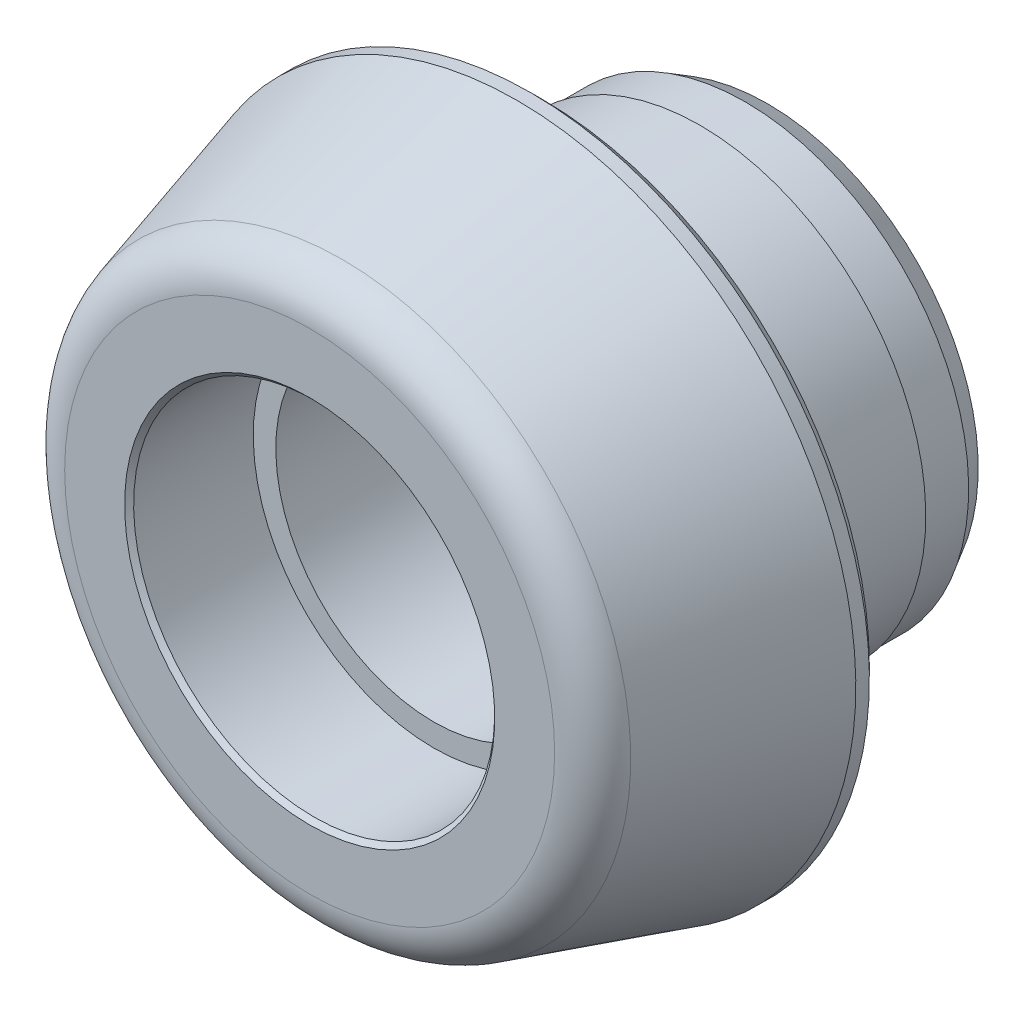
ISO-10303-21;
HEADER;
FILE_DESCRIPTION(('STEP AP214'),'2;1');
FILE_NAME('part.step','',(''),(''),'','','');
FILE_SCHEMA(('AUTOMOTIVE_DESIGN { 1 0 10303 214 1 1 1 1 }'));
ENDSEC;
DATA;
#1=APPLICATION_CONTEXT('core data for automotive mechanical design processes');
#2=APPLICATION_PROTOCOL_DEFINITION('international standard','automotive_design',2000,#1);
#3=PRODUCT_CONTEXT('',#1,'mechanical');
#4=PRODUCT('Part','Part','',(#3));
#5=PRODUCT_RELATED_PRODUCT_CATEGORY('part','',(#4));
#6=PRODUCT_DEFINITION_FORMATION('','',#4);
#7=PRODUCT_DEFINITION_CONTEXT('part definition',#1,'design');
#8=PRODUCT_DEFINITION('design','',#6,#7);
#9=PRODUCT_DEFINITION_SHAPE('','',#8);
#10=(LENGTH_UNIT() NAMED_UNIT(*) SI_UNIT(.MILLI.,.METRE.));
#11=(NAMED_UNIT(*) PLANE_ANGLE_UNIT() SI_UNIT($,.RADIAN.));
#12=(NAMED_UNIT(*) SI_UNIT($,.STERADIAN.) SOLID_ANGLE_UNIT());
#13=UNCERTAINTY_MEASURE_WITH_UNIT(LENGTH_MEASURE(1.E-05),#10,'distance_accuracy_value','');
#14=(GEOMETRIC_REPRESENTATION_CONTEXT(3) GLOBAL_UNCERTAINTY_ASSIGNED_CONTEXT((#13)) GLOBAL_UNIT_ASSIGNED_CONTEXT((#10,
#11,#12)) REPRESENTATION_CONTEXT('',''));
#15=CARTESIAN_POINT('',(0.,0.,0.));
#16=DIRECTION('',(0.,0.,1.));
#17=DIRECTION('',(1.,0.,0.));
#18=AXIS2_PLACEMENT_3D('',#15,#16,#17);
#19=CARTESIAN_POINT('',(0.,0.,10.3));
#20=DIRECTION('',(0.,0.,1.));
#21=DIRECTION('',(0.,-1.,0.));
#22=AXIS2_PLACEMENT_3D('',#19,#20,#21);
#23=CYLINDRICAL_SURFACE('',#22,7.);
#24=CARTESIAN_POINT('',(0.,0.,-9.));
#25=DIRECTION('',(0.,0.,-1.));
#26=DIRECTION('',(0.,1.,0.));
#27=AXIS2_PLACEMENT_3D('',#24,#25,#26);
#28=CIRCLE('',#27,7.);
#29=CARTESIAN_POINT('',(0.,7.,-9.));
#30=VERTEX_POINT('',#29);
#31=EDGE_CURVE('E20',#30,#30,#28,.T.);
#32=ORIENTED_EDGE('',*,*,#31,.T.);
#33=EDGE_LOOP('',(#32));
#34=FACE_BOUND('',#33,.T.);
#35=CARTESIAN_POINT('',(0.,0.,4.8));
#36=DIRECTION('',(0.,0.,1.));
#37=DIRECTION('',(0.,-1.,0.));
#38=AXIS2_PLACEMENT_3D('',#35,#36,#37);
#39=CIRCLE('',#38,7.);
#40=CARTESIAN_POINT('',(0.,-7.,4.8));
#41=VERTEX_POINT('',#40);
#42=EDGE_CURVE('E16',#41,#41,#39,.F.);
#43=ORIENTED_EDGE('',*,*,#42,.F.);
#44=EDGE_LOOP('',(#43));
#45=FACE_BOUND('',#44,.T.);
#46=ADVANCED_FACE('F12',(#34,#45),#23,.F.);
#47=CARTESIAN_POINT('',(0.,0.,-10.));
#48=DIRECTION('',(0.,0.,-1.));
#49=DIRECTION('',(0.,1.,0.));
#50=AXIS2_PLACEMENT_3D('',#47,#48,#49);
#51=CYLINDRICAL_SURFACE('',#50,10.);
#52=CARTESIAN_POINT('',(0.,0.,-7.));
#53=DIRECTION('',(0.,0.,-1.));
#54=DIRECTION('',(0.,1.,0.));
#55=AXIS2_PLACEMENT_3D('',#52,#53,#54);
#56=CIRCLE('',#55,10.);
#57=CARTESIAN_POINT('',(0.,10.,-7.));
#58=VERTEX_POINT('',#57);
#59=EDGE_CURVE('E57',#58,#58,#56,.T.);
#60=ORIENTED_EDGE('',*,*,#59,.F.);
#61=EDGE_LOOP('',(#60));
#62=FACE_BOUND('',#61,.T.);
#63=CARTESIAN_POINT('',(0.,0.,-1.2));
#64=DIRECTION('',(0.,0.,-1.));
#65=DIRECTION('',(0.,1.,0.));
#66=AXIS2_PLACEMENT_3D('',#63,#64,#65);
#67=CIRCLE('',#66,10.);
#68=CARTESIAN_POINT('',(0.,10.,-1.2));
#69=VERTEX_POINT('',#68);
#70=EDGE_CURVE('E51',#69,#69,#67,.T.);
#71=ORIENTED_EDGE('',*,*,#70,.T.);
#72=EDGE_LOOP('',(#71));
#73=FACE_BOUND('',#72,.T.);
#74=ADVANCED_FACE('F102',(#62,#73),#51,.T.);
#75=CARTESIAN_POINT('',(15.,0.,0.));
#76=DIRECTION('',(0.,0.,-1.));
#77=DIRECTION('',(0.,1.,0.));
#78=AXIS2_PLACEMENT_3D('',#75,#76,#77);
#79=PLANE('',#78);
#80=CARTESIAN_POINT('',(0.,0.,0.));
#81=DIRECTION('',(0.,0.,-1.));
#82=DIRECTION('',(0.,1.,0.));
#83=AXIS2_PLACEMENT_3D('',#80,#81,#82);
#84=CIRCLE('',#83,14.5);
#85=CARTESIAN_POINT('',(0.,14.5,0.));
#86=VERTEX_POINT('',#85);
#87=EDGE_CURVE('E69',#86,#86,#84,.T.);
#88=ORIENTED_EDGE('',*,*,#87,.T.);
#89=EDGE_LOOP('',(#88));
#90=FACE_BOUND('',#89,.T.);
#91=CARTESIAN_POINT('',(0.,0.,0.));
#92=DIRECTION('',(0.,0.,-1.));
#93=DIRECTION('',(0.,1.,0.));
#94=AXIS2_PLACEMENT_3D('',#91,#92,#93);
#95=CIRCLE('',#94,10.8);
#96=CARTESIAN_POINT('',(0.,10.8,0.));
#97=VERTEX_POINT('',#96);
#98=EDGE_CURVE('E34',#97,#97,#95,.T.);
#99=ORIENTED_EDGE('',*,*,#98,.F.);
#100=EDGE_LOOP('',(#99));
#101=FACE_BOUND('',#100,.T.);
#102=ADVANCED_FACE('F109',(#90,#101),#79,.T.);
#103=CARTESIAN_POINT('',(10.,0.,-10.));
#104=DIRECTION('',(0.,0.,-1.));
#105=DIRECTION('',(0.,1.,0.));
#106=AXIS2_PLACEMENT_3D('',#103,#104,#105);
#107=PLANE('',#106);
#108=CARTESIAN_POINT('',(0.,0.,-10.));
#109=DIRECTION('',(0.,0.,-1.));
#110=DIRECTION('',(0.,1.,0.));
#111=AXIS2_PLACEMENT_3D('',#108,#109,#110);
#112=CIRCLE('',#111,8.);
#113=CARTESIAN_POINT('',(0.,8.,-10.));
#114=VERTEX_POINT('',#113);
#115=EDGE_CURVE('E8',#114,#114,#112,.F.);
#116=ORIENTED_EDGE('',*,*,#115,.T.);
#117=EDGE_LOOP('',(#116));
#118=FACE_BOUND('',#117,.T.);
#119=CARTESIAN_POINT('',(0.,0.,-10.));
#120=DIRECTION('',(0.,0.,-1.));
#121=DIRECTION('',(0.,1.,0.));
#122=AXIS2_PLACEMENT_3D('',#119,#120,#121);
#123=CIRCLE('',#122,9.32264973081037);
#124=CARTESIAN_POINT('',(0.,9.32264973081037,-10.));
#125=VERTEX_POINT('',#124);
#126=EDGE_CURVE('E75',#125,#125,#123,.T.);
#127=ORIENTED_EDGE('',*,*,#126,.T.);
#128=EDGE_LOOP('',(#127));
#129=FACE_BOUND('',#128,.T.);
#130=ADVANCED_FACE('F119',(#118,#129),#107,.T.);
#131=CARTESIAN_POINT('',(0.,0.,10.3));
#132=DIRECTION('',(0.,0.,1.));
#133=DIRECTION('',(0.,-1.,0.));
#134=AXIS2_PLACEMENT_3D('',#131,#132,#133);
#135=PLANE('',#134);
#136=CARTESIAN_POINT('',(0.,0.,10.3));
#137=DIRECTION('',(0.,0.,1.));
#138=DIRECTION('',(0.,-1.,0.));
#139=AXIS2_PLACEMENT_3D('',#136,#137,#138);
#140=CIRCLE('',#139,8.2);
#141=CARTESIAN_POINT('',(0.,-8.2,10.3));
#142=VERTEX_POINT('',#141);
#143=EDGE_CURVE('E25',#142,#142,#140,.F.);
#144=ORIENTED_EDGE('',*,*,#143,.T.);
#145=EDGE_LOOP('',(#144));
#146=FACE_BOUND('',#145,.T.);
#147=CARTESIAN_POINT('',(0.,0.,10.3));
#148=DIRECTION('',(0.,0.,1.));
#149=DIRECTION('',(0.,-1.,0.));
#150=AXIS2_PLACEMENT_3D('',#147,#148,#149);
#151=CIRCLE('',#150,10.8548343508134);
#152=CARTESIAN_POINT('',(0.,-10.8548343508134,10.3));
#153=VERTEX_POINT('',#152);
#154=EDGE_CURVE('E66',#153,#153,#151,.T.);
#155=ORIENTED_EDGE('',*,*,#154,.T.);
#156=EDGE_LOOP('',(#155));
#157=FACE_BOUND('',#156,.T.);
#158=ADVANCED_FACE('F83',(#146,#157),#135,.T.);
#159=CARTESIAN_POINT('',(0.,0.,1.1));
#160=DIRECTION('',(0.,0.,-1.));
#161=DIRECTION('',(0.,1.,0.));
#162=AXIS2_PLACEMENT_3D('',#159,#160,#161);
#163=CONICAL_SURFACE('',#162,15.,0.279252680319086);
#164=CARTESIAN_POINT('',(0.,0.,8.85127471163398));
#165=DIRECTION('',(0.,0.,1.));
#166=DIRECTION('',(0.,-1.,0.));
#167=AXIS2_PLACEMENT_3D('',#164,#165,#166);
#168=CIRCLE('',#167,12.7773577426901);
#169=CARTESIAN_POINT('',(0.,-12.7773577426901,8.85127471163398));
#170=VERTEX_POINT('',#169);
#171=EDGE_CURVE('E63',#170,#170,#168,.F.);
#172=ORIENTED_EDGE('',*,*,#171,.T.);
#173=EDGE_LOOP('',(#172));
#174=FACE_BOUND('',#173,.T.);
#175=CARTESIAN_POINT('',(0.,0.,1.1));
#176=DIRECTION('',(0.,0.,-1.));
#177=DIRECTION('',(0.,1.,0.));
#178=AXIS2_PLACEMENT_3D('',#175,#176,#177);
#179=CIRCLE('',#178,15.);
#180=CARTESIAN_POINT('',(0.,15.,1.1));
#181=VERTEX_POINT('',#180);
#182=EDGE_CURVE('E60',#181,#181,#179,.T.);
#183=ORIENTED_EDGE('',*,*,#182,.F.);
#184=EDGE_LOOP('',(#183));
#185=FACE_BOUND('',#184,.T.);
#186=ADVANCED_FACE('F124',(#174,#185),#163,.T.);
#187=CARTESIAN_POINT('',(0.,0.,-10.));
#188=DIRECTION('',(0.,0.,-1.));
#189=DIRECTION('',(0.,1.,0.));
#190=AXIS2_PLACEMENT_3D('',#187,#188,#189);
#191=CYLINDRICAL_SURFACE('',#190,15.);
#192=CARTESIAN_POINT('',(0.,0.,0.5));
#193=DIRECTION('',(0.,0.,-1.));
#194=DIRECTION('',(0.,1.,0.));
#195=AXIS2_PLACEMENT_3D('',#192,#193,#194);
#196=CIRCLE('',#195,15.);
#197=CARTESIAN_POINT('',(0.,15.,0.5));
#198=VERTEX_POINT('',#197);
#199=EDGE_CURVE('E72',#198,#198,#196,.F.);
#200=ORIENTED_EDGE('',*,*,#199,.T.);
#201=EDGE_LOOP('',(#200));
#202=FACE_BOUND('',#201,.T.);
#203=ORIENTED_EDGE('',*,*,#182,.T.);
#204=EDGE_LOOP('',(#203));
#205=FACE_BOUND('',#204,.T.);
#206=ADVANCED_FACE('F121',(#202,#205),#191,.T.);
#207=CARTESIAN_POINT('',(-10.,0.,-7.));
#208=DIRECTION('',(0.,0.,-1.));
#209=DIRECTION('',(0.,1.,0.));
#210=AXIS2_PLACEMENT_3D('',#207,#208,#209);
#211=PLANE('',#210);
#212=ORIENTED_EDGE('',*,*,#59,.T.);
#213=EDGE_LOOP('',(#212));
#214=FACE_BOUND('',#213,.T.);
#215=CARTESIAN_POINT('',(0.,0.,-7.));
#216=DIRECTION('',(0.,0.,-1.));
#217=DIRECTION('',(0.,1.,0.));
#218=AXIS2_PLACEMENT_3D('',#215,#216,#217);
#219=CIRCLE('',#218,9.9);
#220=CARTESIAN_POINT('',(0.,9.9,-7.));
#221=VERTEX_POINT('',#220);
#222=EDGE_CURVE('E54',#221,#221,#219,.T.);
#223=ORIENTED_EDGE('',*,*,#222,.F.);
#224=EDGE_LOOP('',(#223));
#225=FACE_BOUND('',#224,.T.);
#226=ADVANCED_FACE('F114',(#214,#225),#211,.T.);
#227=CARTESIAN_POINT('',(0.,0.,-10.));
#228=DIRECTION('',(0.,0.,-1.));
#229=DIRECTION('',(0.,1.,0.));
#230=AXIS2_PLACEMENT_3D('',#227,#228,#229);
#231=CYLINDRICAL_SURFACE('',#230,9.9);
#232=CARTESIAN_POINT('',(0.,0.,-9.));
#233=DIRECTION('',(0.,0.,-1.));
#234=DIRECTION('',(0.,1.,0.));
#235=AXIS2_PLACEMENT_3D('',#232,#233,#234);
#236=CIRCLE('',#235,9.9);
#237=CARTESIAN_POINT('',(0.,9.9,-9.));
#238=VERTEX_POINT('',#237);
#239=EDGE_CURVE('E78',#238,#238,#236,.F.);
#240=ORIENTED_EDGE('',*,*,#239,.T.);
#241=EDGE_LOOP('',(#240));
#242=FACE_BOUND('',#241,.T.);
#243=ORIENTED_EDGE('',*,*,#222,.T.);
#244=EDGE_LOOP('',(#243));
#245=FACE_BOUND('',#244,.T.);
#246=ADVANCED_FACE('F136',(#242,#245),#231,.T.);
#247=CARTESIAN_POINT('',(0.,0.,8.3));
#248=DIRECTION('',(0.,0.,1.));
#249=DIRECTION('',(0.,-1.,0.));
#250=AXIS2_PLACEMENT_3D('',#247,#248,#249);
#251=TOROIDAL_SURFACE('',#250,10.8548343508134,2.);
#252=ORIENTED_EDGE('',*,*,#154,.F.);
#253=EDGE_LOOP('',(#252));
#254=FACE_BOUND('',#253,.T.);
#255=ORIENTED_EDGE('',*,*,#171,.F.);
#256=EDGE_LOOP('',(#255));
#257=FACE_BOUND('',#256,.T.);
#258=ADVANCED_FACE('F133',(#254,#257),#251,.T.);
#259=CARTESIAN_POINT('',(0.,0.,0.));
#260=DIRECTION('',(0.,0.,1.));
#261=DIRECTION('',(0.,-1.,0.));
#262=AXIS2_PLACEMENT_3D('',#259,#260,#261);
#263=CONICAL_SURFACE('',#262,14.5,0.78539816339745);
#264=ORIENTED_EDGE('',*,*,#199,.F.);
#265=EDGE_LOOP('',(#264));
#266=FACE_BOUND('',#265,.T.);
#267=ORIENTED_EDGE('',*,*,#87,.F.);
#268=EDGE_LOOP('',(#267));
#269=FACE_BOUND('',#268,.T.);
#270=ADVANCED_FACE('F98',(#266,#269),#263,.T.);
#271=CARTESIAN_POINT('',(0.,0.,-10.));
#272=DIRECTION('',(0.,0.,1.));
#273=DIRECTION('',(0.,-1.,0.));
#274=AXIS2_PLACEMENT_3D('',#271,#272,#273);
#275=CONICAL_SURFACE('',#274,9.32264973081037,0.523598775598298);
#276=ORIENTED_EDGE('',*,*,#239,.F.);
#277=EDGE_LOOP('',(#276));
#278=FACE_BOUND('',#277,.T.);
#279=ORIENTED_EDGE('',*,*,#126,.F.);
#280=EDGE_LOOP('',(#279));
#281=FACE_BOUND('',#280,.T.);
#282=ADVANCED_FACE('F88',(#278,#281),#275,.T.);
#283=CARTESIAN_POINT('',(0.,0.,9.1));
#284=DIRECTION('',(0.,0.,1.));
#285=DIRECTION('',(0.,-1.,0.));
#286=AXIS2_PLACEMENT_3D('',#283,#284,#285);
#287=CONICAL_SURFACE('',#286,7.,0.78539816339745);
#288=CARTESIAN_POINT('',(0.,0.,10.1));
#289=DIRECTION('',(0.,0.,1.));
#290=DIRECTION('',(0.,-1.,0.));
#291=AXIS2_PLACEMENT_3D('',#288,#289,#290);
#292=CIRCLE('',#291,8.);
#293=CARTESIAN_POINT('',(0.,-8.,10.1));
#294=VERTEX_POINT('',#293);
#295=EDGE_CURVE('E28',#294,#294,#292,.T.);
#296=ORIENTED_EDGE('',*,*,#295,.F.);
#297=EDGE_LOOP('',(#296));
#298=FACE_BOUND('',#297,.T.);
#299=ORIENTED_EDGE('',*,*,#143,.F.);
#300=EDGE_LOOP('',(#299));
#301=FACE_BOUND('',#300,.T.);
#302=ADVANCED_FACE('F86',(#298,#301),#287,.F.);
#303=CARTESIAN_POINT('',(0.,0.,-9.));
#304=DIRECTION('',(0.,0.,-1.));
#305=DIRECTION('',(0.,1.,0.));
#306=AXIS2_PLACEMENT_3D('',#303,#304,#305);
#307=CONICAL_SURFACE('',#306,7.,0.785398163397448);
#308=ORIENTED_EDGE('',*,*,#115,.F.);
#309=EDGE_LOOP('',(#308));
#310=FACE_BOUND('',#309,.T.);
#311=ORIENTED_EDGE('',*,*,#31,.F.);
#312=EDGE_LOOP('',(#311));
#313=FACE_BOUND('',#312,.T.);
#314=ADVANCED_FACE('F14',(#310,#313),#307,.F.);
#315=CARTESIAN_POINT('',(0.,0.,-1.2));
#316=DIRECTION('',(0.,0.,-1.));
#317=DIRECTION('',(0.,1.,0.));
#318=AXIS2_PLACEMENT_3D('',#315,#316,#317);
#319=CONICAL_SURFACE('',#318,10.,0.523598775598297);
#320=CARTESIAN_POINT('',(0.,0.,-0.333974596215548));
#321=DIRECTION('',(0.,0.,-1.));
#322=DIRECTION('',(0.,1.,0.));
#323=AXIS2_PLACEMENT_3D('',#320,#321,#322);
#324=CIRCLE('',#323,9.5);
#325=CARTESIAN_POINT('',(0.,9.5,-0.333974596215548));
#326=VERTEX_POINT('',#325);
#327=EDGE_CURVE('E48',#326,#326,#324,.T.);
#328=ORIENTED_EDGE('',*,*,#327,.T.);
#329=EDGE_LOOP('',(#328));
#330=FACE_BOUND('',#329,.T.);
#331=ORIENTED_EDGE('',*,*,#70,.F.);
#332=EDGE_LOOP('',(#331));
#333=FACE_BOUND('',#332,.T.);
#334=ADVANCED_FACE('F96',(#330,#333),#319,.T.);
#335=CARTESIAN_POINT('',(0.,0.,-10.));
#336=DIRECTION('',(0.,0.,-1.));
#337=DIRECTION('',(0.,1.,0.));
#338=AXIS2_PLACEMENT_3D('',#335,#336,#337);
#339=CYLINDRICAL_SURFACE('',#338,9.5);
#340=CARTESIAN_POINT('',(0.,0.,0.1));
#341=DIRECTION('',(0.,0.,-1.));
#342=DIRECTION('',(0.,1.,0.));
#343=AXIS2_PLACEMENT_3D('',#340,#341,#342);
#344=CIRCLE('',#343,9.5);
#345=CARTESIAN_POINT('',(0.,9.5,0.1));
#346=VERTEX_POINT('',#345);
#347=EDGE_CURVE('E45',#346,#346,#344,.T.);
#348=ORIENTED_EDGE('',*,*,#347,.T.);
#349=EDGE_LOOP('',(#348));
#350=FACE_BOUND('',#349,.T.);
#351=ORIENTED_EDGE('',*,*,#327,.F.);
#352=EDGE_LOOP('',(#351));
#353=FACE_BOUND('',#352,.T.);
#354=ADVANCED_FACE('F159',(#350,#353),#339,.T.);
#355=CARTESIAN_POINT('',(0.,0.,0.1));
#356=DIRECTION('',(0.,0.,-1.));
#357=DIRECTION('',(0.,1.,0.));
#358=AXIS2_PLACEMENT_3D('',#355,#356,#357);
#359=TOROIDAL_SURFACE('',#358,9.89999999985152,0.399999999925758);
#360=CARTESIAN_POINT('',(0.,0.,0.499999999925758));
#361=DIRECTION('',(0.,0.,-1.));
#362=DIRECTION('',(0.,1.,0.));
#363=AXIS2_PLACEMENT_3D('',#360,#361,#362);
#364=CIRCLE('',#363,9.89999999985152);
#365=CARTESIAN_POINT('',(0.,9.89999999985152,0.499999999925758));
#366=VERTEX_POINT('',#365);
#367=EDGE_CURVE('E42',#366,#366,#364,.T.);
#368=ORIENTED_EDGE('',*,*,#367,.T.);
#369=EDGE_LOOP('',(#368));
#370=FACE_BOUND('',#369,.T.);
#371=ORIENTED_EDGE('',*,*,#347,.F.);
#372=EDGE_LOOP('',(#371));
#373=FACE_BOUND('',#372,.T.);
#374=ADVANCED_FACE('F153',(#370,#373),#359,.F.);
#375=CARTESIAN_POINT('',(0.,0.,0.499999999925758));
#376=DIRECTION('',(0.,0.,-1.));
#377=DIRECTION('',(0.,1.,0.));
#378=AXIS2_PLACEMENT_3D('',#375,#376,#377);
#379=CONICAL_SURFACE('',#378,9.89999999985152,1.06369782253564);
#380=ORIENTED_EDGE('',*,*,#98,.T.);
#381=EDGE_LOOP('',(#380));
#382=FACE_BOUND('',#381,.T.);
#383=ORIENTED_EDGE('',*,*,#367,.F.);
#384=EDGE_LOOP('',(#383));
#385=FACE_BOUND('',#384,.T.);
#386=ADVANCED_FACE('F149',(#382,#385),#379,.F.);
#387=CARTESIAN_POINT('',(0.,0.,4.8));
#388=DIRECTION('',(0.,0.,1.));
#389=DIRECTION('',(0.,-1.,0.));
#390=AXIS2_PLACEMENT_3D('',#387,#388,#389);
#391=PLANE('',#390);
#392=CARTESIAN_POINT('',(0.,0.,4.8));
#393=DIRECTION('',(0.,0.,1.));
#394=DIRECTION('',(0.,-1.,0.));
#395=AXIS2_PLACEMENT_3D('',#392,#393,#394);
#396=CIRCLE('',#395,8.);
#397=CARTESIAN_POINT('',(0.,-8.,4.8));
#398=VERTEX_POINT('',#397);
#399=EDGE_CURVE('E30',#398,#398,#396,.T.);
#400=ORIENTED_EDGE('',*,*,#399,.T.);
#401=EDGE_LOOP('',(#400));
#402=FACE_BOUND('',#401,.T.);
#403=ORIENTED_EDGE('',*,*,#42,.T.);
#404=EDGE_LOOP('',(#403));
#405=FACE_BOUND('',#404,.T.);
#406=ADVANCED_FACE('F152',(#402,#405),#391,.T.);
#407=CARTESIAN_POINT('',(0.,0.,4.8));
#408=DIRECTION('',(0.,0.,1.));
#409=DIRECTION('',(0.,-1.,0.));
#410=AXIS2_PLACEMENT_3D('',#407,#408,#409);
#411=CYLINDRICAL_SURFACE('',#410,8.);
#412=ORIENTED_EDGE('',*,*,#295,.T.);
#413=EDGE_LOOP('',(#412));
#414=FACE_BOUND('',#413,.T.);
#415=ORIENTED_EDGE('',*,*,#399,.F.);
#416=EDGE_LOOP('',(#415));
#417=FACE_BOUND('',#416,.T.);
#418=ADVANCED_FACE('F274',(#414,#417),#411,.F.);
#419=CLOSED_SHELL('',(#46,#74,#102,#130,#158,#186,#206,#226,#246,#258,#270,#282,#302,#314,#334,
#354,#374,#386,#406,#418));
#420=MANIFOLD_SOLID_BREP('B1',#419);
#421=ADVANCED_BREP_SHAPE_REPRESENTATION('',(#18,#420),#14);
#422=SHAPE_DEFINITION_REPRESENTATION(#9,#421);
ENDSEC;
END-ISO-10303-21;
